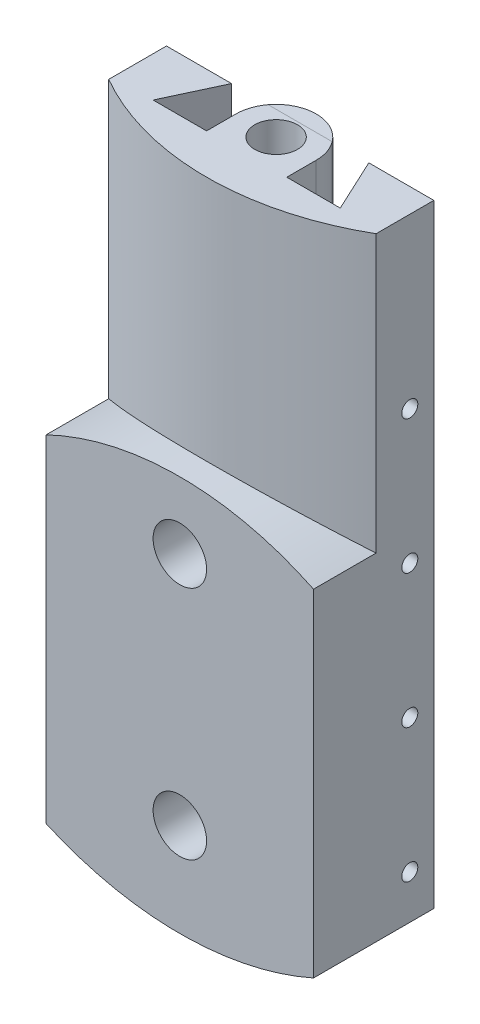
ISO-10303-21;
HEADER;
FILE_DESCRIPTION(('STEP AP214'),'2;1');
FILE_NAME('part.step','',(''),(''),'','','');
FILE_SCHEMA(('AUTOMOTIVE_DESIGN { 1 0 10303 214 1 1 1 1 }'));
ENDSEC;
DATA;
#1=APPLICATION_CONTEXT('core data for automotive mechanical design processes');
#2=APPLICATION_PROTOCOL_DEFINITION('international standard','automotive_design',2000,#1);
#3=PRODUCT_CONTEXT('',#1,'mechanical');
#4=PRODUCT('Part','Part','',(#3));
#5=PRODUCT_RELATED_PRODUCT_CATEGORY('part','',(#4));
#6=PRODUCT_DEFINITION_FORMATION('','',#4);
#7=PRODUCT_DEFINITION_CONTEXT('part definition',#1,'design');
#8=PRODUCT_DEFINITION('design','',#6,#7);
#9=PRODUCT_DEFINITION_SHAPE('','',#8);
#10=(LENGTH_UNIT() NAMED_UNIT(*) SI_UNIT(.MILLI.,.METRE.));
#11=(NAMED_UNIT(*) PLANE_ANGLE_UNIT() SI_UNIT($,.RADIAN.));
#12=(NAMED_UNIT(*) SI_UNIT($,.STERADIAN.) SOLID_ANGLE_UNIT());
#13=UNCERTAINTY_MEASURE_WITH_UNIT(LENGTH_MEASURE(1.E-05),#10,'distance_accuracy_value','');
#14=(GEOMETRIC_REPRESENTATION_CONTEXT(3) GLOBAL_UNCERTAINTY_ASSIGNED_CONTEXT((#13)) GLOBAL_UNIT_ASSIGNED_CONTEXT((#10,
#11,#12)) REPRESENTATION_CONTEXT('',''));
#15=CARTESIAN_POINT('',(0.,0.,0.));
#16=DIRECTION('',(0.,0.,1.));
#17=DIRECTION('',(1.,0.,0.));
#18=AXIS2_PLACEMENT_3D('',#15,#16,#17);
#19=CARTESIAN_POINT('',(0.,94.9999999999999,9.));
#20=DIRECTION('',(0.,1.,0.));
#21=DIRECTION('',(-1.,0.,0.));
#22=AXIS2_PLACEMENT_3D('',#19,#20,#21);
#23=CYLINDRICAL_SURFACE('',#22,15.);
#24=CARTESIAN_POINT('',(0.,120.,9.));
#25=DIRECTION('',(0.,1.,0.));
#26=DIRECTION('',(-1.,0.,0.));
#27=AXIS2_PLACEMENT_3D('',#24,#25,#26);
#28=CIRCLE('',#27,15.);
#29=CARTESIAN_POINT('',(11.9998799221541,120.,-0.000160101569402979));
#30=VERTEX_POINT('',#29);
#31=CARTESIAN_POINT('',(-11.9998799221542,120.,-0.000160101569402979));
#32=VERTEX_POINT('',#31);
#33=EDGE_CURVE('E72',#30,#32,#28,.T.);
#34=ORIENTED_EDGE('',*,*,#33,.F.);
#35=DIRECTION('',(0.,1.,0.));
#36=VECTOR('',#35,1.);
#37=CARTESIAN_POINT('',(11.9998799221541,94.9999999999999,-0.000160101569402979));
#38=LINE('',#37,#36);
#39=CARTESIAN_POINT('',(11.9998799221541,94.9999999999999,-0.000160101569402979));
#40=VERTEX_POINT('',#39);
#41=EDGE_CURVE('E12',#40,#30,#38,.T.);
#42=ORIENTED_EDGE('',*,*,#41,.F.);
#43=CARTESIAN_POINT('',(0.,94.9999999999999,9.));
#44=DIRECTION('',(0.,1.,0.));
#45=DIRECTION('',(-1.,0.,0.));
#46=AXIS2_PLACEMENT_3D('',#43,#44,#45);
#47=CIRCLE('',#46,15.);
#48=CARTESIAN_POINT('',(-11.9998799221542,94.9999999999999,-0.000160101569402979));
#49=VERTEX_POINT('',#48);
#50=EDGE_CURVE('E76',#40,#49,#47,.T.);
#51=ORIENTED_EDGE('',*,*,#50,.T.);
#52=DIRECTION('',(0.,1.,0.));
#53=VECTOR('',#52,1.);
#54=CARTESIAN_POINT('',(-11.9998799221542,94.9999999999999,-0.000160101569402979));
#55=LINE('',#54,#53);
#56=EDGE_CURVE('E46',#49,#32,#55,.T.);
#57=ORIENTED_EDGE('',*,*,#56,.T.);
#58=EDGE_LOOP('',(#34,#42,#51,#57));
#59=FACE_BOUND('',#58,.T.);
#60=ADVANCED_FACE('F43',(#59),#23,.T.);
#61=CARTESIAN_POINT('',(-11.9998799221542,94.9999999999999,-0.000160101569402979));
#62=DIRECTION('',(0.,0.,1.));
#63=DIRECTION('',(1.,0.,0.));
#64=AXIS2_PLACEMENT_3D('',#61,#62,#63);
#65=PLANE('',#64);
#66=DIRECTION('',(1.,0.,0.));
#67=VECTOR('',#66,1.);
#68=CARTESIAN_POINT('',(-11.9998799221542,120.,-0.000160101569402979));
#69=LINE('',#68,#67);
#70=EDGE_CURVE('E69',#32,#30,#69,.T.);
#71=ORIENTED_EDGE('',*,*,#70,.F.);
#72=ORIENTED_EDGE('',*,*,#56,.F.);
#73=DIRECTION('',(1.,0.,0.));
#74=VECTOR('',#73,1.);
#75=CARTESIAN_POINT('',(-11.9998799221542,94.9999999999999,-0.000160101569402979));
#76=LINE('',#75,#74);
#77=EDGE_CURVE('E71',#49,#40,#76,.T.);
#78=ORIENTED_EDGE('',*,*,#77,.T.);
#79=ORIENTED_EDGE('',*,*,#41,.T.);
#80=EDGE_LOOP('',(#71,#72,#78,#79));
#81=FACE_BOUND('',#80,.T.);
#82=ADVANCED_FACE('F67',(#81),#65,.T.);
#83=CARTESIAN_POINT('',(0.,94.9999999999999,9.));
#84=DIRECTION('',(0.,1.,0.));
#85=DIRECTION('',(-1.,0.,0.));
#86=AXIS2_PLACEMENT_3D('',#83,#84,#85);
#87=PLANE('',#86);
#88=ORIENTED_EDGE('',*,*,#50,.F.);
#89=ORIENTED_EDGE('',*,*,#77,.F.);
#90=EDGE_LOOP('',(#88,#89));
#91=FACE_BOUND('',#90,.T.);
#92=ADVANCED_FACE('F81',(#91),#87,.F.);
#93=CARTESIAN_POINT('',(0.,120.,9.));
#94=DIRECTION('',(0.,1.,0.));
#95=DIRECTION('',(-1.,0.,0.));
#96=AXIS2_PLACEMENT_3D('',#93,#94,#95);
#97=PLANE('',#96);
#98=ORIENTED_EDGE('',*,*,#33,.T.);
#99=ORIENTED_EDGE('',*,*,#70,.T.);
#100=EDGE_LOOP('',(#98,#99));
#101=FACE_BOUND('',#100,.T.);
#102=ADVANCED_FACE('F75',(#101),#97,.T.);
#103=CLOSED_SHELL('',(#60,#82,#92,#102));
#104=MANIFOLD_SOLID_BREP('B2',#103);
#105=CARTESIAN_POINT('',(50.,120.,45.));
#106=DIRECTION('',(0.,-1.,0.));
#107=DIRECTION('',(1.,0.,0.));
#108=AXIS2_PLACEMENT_3D('',#105,#106,#107);
#109=PLANE('',#108);
#110=CARTESIAN_POINT('',(0.,120.,9.));
#111=DIRECTION('',(0.,1.,0.));
#112=DIRECTION('',(-1.,0.,0.));
#113=AXIS2_PLACEMENT_3D('',#110,#111,#112);
#114=CIRCLE('',#113,8.);
#115=CARTESIAN_POINT('',(-8.00000000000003,120.,9.));
#116=VERTEX_POINT('',#115);
#117=EDGE_CURVE('E285',#116,#116,#114,.T.);
#118=ORIENTED_EDGE('',*,*,#117,.F.);
#119=EDGE_LOOP('',(#118));
#120=FACE_BOUND('',#119,.T.);
#121=CARTESIAN_POINT('',(0.,120.,9.));
#122=DIRECTION('',(0.,1.,0.));
#123=DIRECTION('',(-1.,0.,0.));
#124=AXIS2_PLACEMENT_3D('',#121,#122,#123);
#125=CIRCLE('',#124,15.);
#126=CARTESIAN_POINT('',(15.,120.,9.));
#127=VERTEX_POINT('',#126);
#128=CARTESIAN_POINT('',(12.,120.,0.));
#129=VERTEX_POINT('',#128);
#130=EDGE_CURVE('E329',#127,#129,#125,.T.);
#131=ORIENTED_EDGE('',*,*,#130,.T.);
#132=DIRECTION('',(-1.,0.,0.));
#133=VECTOR('',#132,1.);
#134=CARTESIAN_POINT('',(50.,120.,0.));
#135=LINE('',#134,#133);
#136=CARTESIAN_POINT('',(-12.,120.,0.));
#137=VERTEX_POINT('',#136);
#138=EDGE_CURVE('E278',#129,#137,#135,.T.);
#139=ORIENTED_EDGE('',*,*,#138,.T.);
#140=CARTESIAN_POINT('',(0.,120.,9.));
#141=DIRECTION('',(0.,1.,0.));
#142=DIRECTION('',(-1.,0.,0.));
#143=AXIS2_PLACEMENT_3D('',#140,#141,#142);
#144=CIRCLE('',#143,15.);
#145=CARTESIAN_POINT('',(-15.,120.,9.));
#146=VERTEX_POINT('',#145);
#147=EDGE_CURVE('E343',#137,#146,#144,.T.);
#148=ORIENTED_EDGE('',*,*,#147,.T.);
#149=DIRECTION('',(0.,0.,1.));
#150=VECTOR('',#149,1.);
#151=CARTESIAN_POINT('',(-15.,120.,0.));
#152=LINE('',#151,#150);
#153=CARTESIAN_POINT('',(-15.,120.,20.));
#154=VERTEX_POINT('',#153);
#155=EDGE_CURVE('E360',#146,#154,#152,.T.);
#156=ORIENTED_EDGE('',*,*,#155,.T.);
#157=DIRECTION('',(-1.,0.,0.));
#158=VECTOR('',#157,1.);
#159=CARTESIAN_POINT('',(0.,120.,20.));
#160=LINE('',#159,#158);
#161=CARTESIAN_POINT('',(-35.,120.,20.));
#162=VERTEX_POINT('',#161);
#163=EDGE_CURVE('E357',#154,#162,#160,.T.);
#164=ORIENTED_EDGE('',*,*,#163,.T.);
#165=DIRECTION('',(0.422618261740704,0.,-0.906307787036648));
#166=VECTOR('',#165,1.);
#167=CARTESIAN_POINT('',(-21.0883387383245,120.,-9.83365385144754));
#168=LINE('',#167,#166);
#169=CARTESIAN_POINT('',(-25.6738468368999,120.,0.));
#170=VERTEX_POINT('',#169);
#171=EDGE_CURVE('E354',#162,#170,#168,.T.);
#172=ORIENTED_EDGE('',*,*,#171,.T.);
#173=CARTESIAN_POINT('',(-50.,120.,0.));
#174=VERTEX_POINT('',#173);
#175=EDGE_CURVE('E276',#170,#174,#135,.T.);
#176=ORIENTED_EDGE('',*,*,#175,.T.);
#177=DIRECTION('',(0.,0.,-1.));
#178=VECTOR('',#177,1.);
#179=CARTESIAN_POINT('',(-50.,120.,45.));
#180=LINE('',#179,#178);
#181=CARTESIAN_POINT('',(-50.,120.,21.6025403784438));
#182=VERTEX_POINT('',#181);
#183=EDGE_CURVE('E261',#182,#174,#180,.T.);
#184=ORIENTED_EDGE('',*,*,#183,.F.);
#185=CARTESIAN_POINT('',(2.23432383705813E-13,120.,-65.));
#186=DIRECTION('',(0.,-1.,0.));
#187=DIRECTION('',(1.,0.,0.));
#188=AXIS2_PLACEMENT_3D('',#185,#186,#187);
#189=CIRCLE('',#188,100.);
#190=CARTESIAN_POINT('',(50.,120.,21.602540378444));
#191=VERTEX_POINT('',#190);
#192=EDGE_CURVE('E366',#191,#182,#189,.T.);
#193=ORIENTED_EDGE('',*,*,#192,.F.);
#194=DIRECTION('',(0.,0.,-1.));
#195=VECTOR('',#194,1.);
#196=CARTESIAN_POINT('',(50.,120.,45.));
#197=LINE('',#196,#195);
#198=CARTESIAN_POINT('',(50.,120.,0.));
#199=VERTEX_POINT('',#198);
#200=EDGE_CURVE('E127',#191,#199,#197,.T.);
#201=ORIENTED_EDGE('',*,*,#200,.T.);
#202=CARTESIAN_POINT('',(25.6738468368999,120.,0.));
#203=VERTEX_POINT('',#202);
#204=EDGE_CURVE('E266',#199,#203,#135,.T.);
#205=ORIENTED_EDGE('',*,*,#204,.T.);
#206=DIRECTION('',(-0.422618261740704,0.,-0.906307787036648));
#207=VECTOR('',#206,1.);
#208=CARTESIAN_POINT('',(21.0883387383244,120.,-9.83365385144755));
#209=LINE('',#208,#207);
#210=CARTESIAN_POINT('',(35.,120.,20.));
#211=VERTEX_POINT('',#210);
#212=EDGE_CURVE('E338',#211,#203,#209,.T.);
#213=ORIENTED_EDGE('',*,*,#212,.F.);
#214=DIRECTION('',(1.,0.,0.));
#215=VECTOR('',#214,1.);
#216=CARTESIAN_POINT('',(0.,120.,20.));
#217=LINE('',#216,#215);
#218=CARTESIAN_POINT('',(15.,120.,20.));
#219=VERTEX_POINT('',#218);
#220=EDGE_CURVE('E335',#219,#211,#217,.T.);
#221=ORIENTED_EDGE('',*,*,#220,.F.);
#222=DIRECTION('',(0.,0.,1.));
#223=VECTOR('',#222,1.);
#224=CARTESIAN_POINT('',(15.,120.,0.));
#225=LINE('',#224,#223);
#226=EDGE_CURVE('E332',#127,#219,#225,.T.);
#227=ORIENTED_EDGE('',*,*,#226,.F.);
#228=EDGE_LOOP('',(#131,#139,#148,#156,#164,#172,#176,#184,#193,#201,#205,#213,#221,#227));
#229=FACE_BOUND('',#228,.T.);
#230=ADVANCED_FACE('F115',(#120,#229),#109,.F.);
#231=CARTESIAN_POINT('',(0.,0.,0.));
#232=DIRECTION('',(0.,0.,1.));
#233=DIRECTION('',(1.,0.,0.));
#234=AXIS2_PLACEMENT_3D('',#231,#232,#233);
#235=PLANE('',#234);
#236=DIRECTION('',(0.,1.,0.));
#237=VECTOR('',#236,1.);
#238=CARTESIAN_POINT('',(12.,-120.,0.));
#239=LINE('',#238,#237);
#240=CARTESIAN_POINT('',(12.,-119.413234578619,0.));
#241=VERTEX_POINT('',#240);
#242=EDGE_CURVE('E341',#241,#129,#239,.T.);
#243=ORIENTED_EDGE('',*,*,#242,.F.);
#244=CARTESIAN_POINT('',(0.,3.,0.));
#245=DIRECTION('',(0.,0.,1.));
#246=DIRECTION('',(1.,0.,0.));
#247=AXIS2_PLACEMENT_3D('',#244,#245,#246);
#248=CIRCLE('',#247,123.);
#249=CARTESIAN_POINT('',(-12.,-119.413234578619,0.));
#250=VERTEX_POINT('',#249);
#251=EDGE_CURVE('E407',#241,#250,#248,.F.);
#252=ORIENTED_EDGE('',*,*,#251,.T.);
#253=DIRECTION('',(0.,1.,0.));
#254=VECTOR('',#253,1.);
#255=CARTESIAN_POINT('',(-12.,-120.,0.));
#256=LINE('',#255,#254);
#257=EDGE_CURVE('E363',#250,#137,#256,.T.);
#258=ORIENTED_EDGE('',*,*,#257,.T.);
#259=ORIENTED_EDGE('',*,*,#138,.F.);
#260=EDGE_LOOP('',(#243,#252,#258,#259));
#261=FACE_BOUND('',#260,.T.);
#262=ADVANCED_FACE('F471',(#261),#235,.F.);
#263=DIRECTION('',(0.,1.,0.));
#264=VECTOR('',#263,1.);
#265=CARTESIAN_POINT('',(50.,-120.,0.));
#266=LINE('',#265,#264);
#267=CARTESIAN_POINT('',(49.9999999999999,-109.378823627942,1.11022302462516E-13));
#268=VERTEX_POINT('',#267);
#269=EDGE_CURVE('E273',#268,#199,#266,.T.);
#270=ORIENTED_EDGE('',*,*,#269,.F.);
#271=CARTESIAN_POINT('',(0.,3.,0.));
#272=DIRECTION('',(0.,0.,1.));
#273=DIRECTION('',(1.,0.,0.));
#274=AXIS2_PLACEMENT_3D('',#271,#272,#273);
#275=CIRCLE('',#274,123.);
#276=CARTESIAN_POINT('',(25.6738468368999,-117.290704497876,0.));
#277=VERTEX_POINT('',#276);
#278=EDGE_CURVE('E409',#268,#277,#275,.F.);
#279=ORIENTED_EDGE('',*,*,#278,.T.);
#280=DIRECTION('',(0.,1.,0.));
#281=VECTOR('',#280,1.);
#282=CARTESIAN_POINT('',(25.6738468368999,-120.,0.));
#283=LINE('',#282,#281);
#284=EDGE_CURVE('E142',#277,#203,#283,.T.);
#285=ORIENTED_EDGE('',*,*,#284,.T.);
#286=ORIENTED_EDGE('',*,*,#204,.F.);
#287=EDGE_LOOP('',(#270,#279,#285,#286));
#288=FACE_BOUND('',#287,.T.);
#289=ADVANCED_FACE('F477',(#288),#235,.F.);
#290=DIRECTION('',(0.,1.,0.));
#291=VECTOR('',#290,1.);
#292=CARTESIAN_POINT('',(-25.6738468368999,-120.,0.));
#293=LINE('',#292,#291);
#294=CARTESIAN_POINT('',(-25.6738468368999,-117.290704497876,0.));
#295=VERTEX_POINT('',#294);
#296=EDGE_CURVE('E371',#295,#170,#293,.T.);
#297=ORIENTED_EDGE('',*,*,#296,.F.);
#298=CARTESIAN_POINT('',(0.,3.,0.));
#299=DIRECTION('',(0.,0.,1.));
#300=DIRECTION('',(1.,0.,0.));
#301=AXIS2_PLACEMENT_3D('',#298,#299,#300);
#302=CIRCLE('',#301,123.);
#303=CARTESIAN_POINT('',(-50.,-109.378823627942,1.11022302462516E-13));
#304=VERTEX_POINT('',#303);
#305=EDGE_CURVE('E520',#295,#304,#302,.F.);
#306=ORIENTED_EDGE('',*,*,#305,.T.);
#307=DIRECTION('',(0.,-1.,0.));
#308=VECTOR('',#307,1.);
#309=CARTESIAN_POINT('',(-50.,-120.,0.));
#310=LINE('',#309,#308);
#311=EDGE_CURVE('E270',#174,#304,#310,.T.);
#312=ORIENTED_EDGE('',*,*,#311,.F.);
#313=ORIENTED_EDGE('',*,*,#175,.F.);
#314=EDGE_LOOP('',(#297,#306,#312,#313));
#315=FACE_BOUND('',#314,.T.);
#316=ADVANCED_FACE('F480',(#315),#235,.F.);
#317=CARTESIAN_POINT('',(-50.,-120.,45.));
#318=DIRECTION('',(1.,0.,0.));
#319=DIRECTION('',(0.,0.,-1.));
#320=AXIS2_PLACEMENT_3D('',#317,#318,#319);
#321=PLANE('',#320);
#322=CARTESIAN_POINT('',(-50.,7.00000000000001,8.99999999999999));
#323=DIRECTION('',(1.,0.,0.));
#324=DIRECTION('',(0.,0.,-1.));
#325=AXIS2_PLACEMENT_3D('',#322,#323,#324);
#326=CIRCLE('',#325,3.);
#327=CARTESIAN_POINT('',(-50.,7.00000000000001,5.99999999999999));
#328=VERTEX_POINT('',#327);
#329=EDGE_CURVE('E306',#328,#328,#326,.T.);
#330=ORIENTED_EDGE('',*,*,#329,.T.);
#331=EDGE_LOOP('',(#330));
#332=FACE_BOUND('',#331,.T.);
#333=CARTESIAN_POINT('',(-50.,-43.,8.99999999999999));
#334=DIRECTION('',(1.,0.,0.));
#335=DIRECTION('',(0.,0.,-1.));
#336=AXIS2_PLACEMENT_3D('',#333,#334,#335);
#337=CIRCLE('',#336,3.);
#338=CARTESIAN_POINT('',(-50.,-43.,5.99999999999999));
#339=VERTEX_POINT('',#338);
#340=EDGE_CURVE('E805',#339,#339,#337,.T.);
#341=ORIENTED_EDGE('',*,*,#340,.T.);
#342=EDGE_LOOP('',(#341));
#343=FACE_BOUND('',#342,.T.);
#344=CARTESIAN_POINT('',(-50.,-93.,8.99999999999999));
#345=DIRECTION('',(1.,0.,0.));
#346=DIRECTION('',(0.,0.,-1.));
#347=AXIS2_PLACEMENT_3D('',#344,#345,#346);
#348=CIRCLE('',#347,3.);
#349=CARTESIAN_POINT('',(-50.,-93.,5.99999999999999));
#350=VERTEX_POINT('',#349);
#351=EDGE_CURVE('E318',#350,#350,#348,.T.);
#352=ORIENTED_EDGE('',*,*,#351,.T.);
#353=EDGE_LOOP('',(#352));
#354=FACE_BOUND('',#353,.T.);
#355=CARTESIAN_POINT('',(-50.,57.,8.99999999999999));
#356=DIRECTION('',(1.,0.,0.));
#357=DIRECTION('',(0.,0.,-1.));
#358=AXIS2_PLACEMENT_3D('',#355,#356,#357);
#359=CIRCLE('',#358,3.);
#360=CARTESIAN_POINT('',(-50.,57.,5.99999999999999));
#361=VERTEX_POINT('',#360);
#362=EDGE_CURVE('E301',#361,#361,#359,.T.);
#363=ORIENTED_EDGE('',*,*,#362,.T.);
#364=EDGE_LOOP('',(#363));
#365=FACE_BOUND('',#364,.T.);
#366=DIRECTION('',(0.,0.,1.));
#367=VECTOR('',#366,1.);
#368=CARTESIAN_POINT('',(-50.,16.5615758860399,-6.00100000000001));
#369=LINE('',#368,#367);
#370=CARTESIAN_POINT('',(-50.,16.5615758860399,21.6025403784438));
#371=VERTEX_POINT('',#370);
#372=CARTESIAN_POINT('',(-50.,16.5615758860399,45.));
#373=VERTEX_POINT('',#372);
#374=EDGE_CURVE('E240',#371,#373,#369,.T.);
#375=ORIENTED_EDGE('',*,*,#374,.F.);
#376=DIRECTION('',(0.,-1.,0.));
#377=VECTOR('',#376,1.);
#378=CARTESIAN_POINT('',(-50.0000000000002,749.831870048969,21.6025403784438));
#379=LINE('',#378,#377);
#380=EDGE_CURVE('E274',#182,#371,#379,.T.);
#381=ORIENTED_EDGE('',*,*,#380,.F.);
#382=ORIENTED_EDGE('',*,*,#183,.T.);
#383=ORIENTED_EDGE('',*,*,#311,.T.);
#384=DIRECTION('',(0.,0.,-1.));
#385=VECTOR('',#384,1.);
#386=CARTESIAN_POINT('',(-50.,-109.378823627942,432.443591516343));
#387=LINE('',#386,#385);
#388=CARTESIAN_POINT('',(-50.,-109.378823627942,45.0000000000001));
#389=VERTEX_POINT('',#388);
#390=EDGE_CURVE('E399',#389,#304,#387,.T.);
#391=ORIENTED_EDGE('',*,*,#390,.F.);
#392=DIRECTION('',(0.,-1.,0.));
#393=VECTOR('',#392,1.);
#394=CARTESIAN_POINT('',(-50.,-120.,45.));
#395=LINE('',#394,#393);
#396=EDGE_CURVE('E262',#373,#389,#395,.T.);
#397=ORIENTED_EDGE('',*,*,#396,.F.);
#398=EDGE_LOOP('',(#375,#381,#382,#383,#391,#397));
#399=FACE_BOUND('',#398,.T.);
#400=ADVANCED_FACE('F117',(#332,#343,#354,#365,#399),#321,.F.);
#401=CARTESIAN_POINT('',(50.,-120.,45.));
#402=DIRECTION('',(-1.,0.,0.));
#403=DIRECTION('',(0.,0.,1.));
#404=AXIS2_PLACEMENT_3D('',#401,#402,#403);
#405=PLANE('',#404);
#406=CARTESIAN_POINT('',(50.,7.00000000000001,8.99999999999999));
#407=DIRECTION('',(1.,0.,0.));
#408=DIRECTION('',(0.,0.,-1.));
#409=AXIS2_PLACEMENT_3D('',#406,#407,#408);
#410=CIRCLE('',#409,3.);
#411=CARTESIAN_POINT('',(50.,7.00000000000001,5.99999999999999));
#412=VERTEX_POINT('',#411);
#413=EDGE_CURVE('E291',#412,#412,#410,.T.);
#414=ORIENTED_EDGE('',*,*,#413,.F.);
#415=EDGE_LOOP('',(#414));
#416=FACE_BOUND('',#415,.T.);
#417=CARTESIAN_POINT('',(50.,-43.,8.99999999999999));
#418=DIRECTION('',(1.,0.,0.));
#419=DIRECTION('',(0.,0.,-1.));
#420=AXIS2_PLACEMENT_3D('',#417,#418,#419);
#421=CIRCLE('',#420,3.);
#422=CARTESIAN_POINT('',(50.,-43.,5.99999999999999));
#423=VERTEX_POINT('',#422);
#424=EDGE_CURVE('E322',#423,#423,#421,.T.);
#425=ORIENTED_EDGE('',*,*,#424,.F.);
#426=EDGE_LOOP('',(#425));
#427=FACE_BOUND('',#426,.T.);
#428=CARTESIAN_POINT('',(50.,-93.,8.99999999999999));
#429=DIRECTION('',(1.,0.,0.));
#430=DIRECTION('',(0.,0.,-1.));
#431=AXIS2_PLACEMENT_3D('',#428,#429,#430);
#432=CIRCLE('',#431,3.);
#433=CARTESIAN_POINT('',(50.,-93.,5.99999999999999));
#434=VERTEX_POINT('',#433);
#435=EDGE_CURVE('E300',#434,#434,#432,.T.);
#436=ORIENTED_EDGE('',*,*,#435,.F.);
#437=EDGE_LOOP('',(#436));
#438=FACE_BOUND('',#437,.T.);
#439=CARTESIAN_POINT('',(50.,57.,8.99999999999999));
#440=DIRECTION('',(1.,0.,0.));
#441=DIRECTION('',(0.,0.,-1.));
#442=AXIS2_PLACEMENT_3D('',#439,#440,#441);
#443=CIRCLE('',#442,3.);
#444=CARTESIAN_POINT('',(50.,57.,5.99999999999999));
#445=VERTEX_POINT('',#444);
#446=EDGE_CURVE('E286',#445,#445,#443,.T.);
#447=ORIENTED_EDGE('',*,*,#446,.F.);
#448=EDGE_LOOP('',(#447));
#449=FACE_BOUND('',#448,.T.);
#450=DIRECTION('',(0.,-1.,0.));
#451=VECTOR('',#450,1.);
#452=CARTESIAN_POINT('',(49.9999999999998,749.831870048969,21.602540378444));
#453=LINE('',#452,#451);
#454=CARTESIAN_POINT('',(50.,16.5615758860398,21.602540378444));
#455=VERTEX_POINT('',#454);
#456=EDGE_CURVE('E253',#191,#455,#453,.T.);
#457=ORIENTED_EDGE('',*,*,#456,.T.);
#458=DIRECTION('',(0.,0.,1.));
#459=VECTOR('',#458,1.);
#460=CARTESIAN_POINT('',(50.,16.5615758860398,-6.00100000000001));
#461=LINE('',#460,#459);
#462=CARTESIAN_POINT('',(50.,16.5615758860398,45.));
#463=VERTEX_POINT('',#462);
#464=EDGE_CURVE('E238',#455,#463,#461,.T.);
#465=ORIENTED_EDGE('',*,*,#464,.T.);
#466=DIRECTION('',(0.,1.,0.));
#467=VECTOR('',#466,1.);
#468=CARTESIAN_POINT('',(50.,-120.,45.));
#469=LINE('',#468,#467);
#470=CARTESIAN_POINT('',(49.9999999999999,-109.378823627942,45.0000000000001));
#471=VERTEX_POINT('',#470);
#472=EDGE_CURVE('E250',#471,#463,#469,.T.);
#473=ORIENTED_EDGE('',*,*,#472,.F.);
#474=DIRECTION('',(0.,0.,-1.));
#475=VECTOR('',#474,1.);
#476=CARTESIAN_POINT('',(49.9999999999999,-109.378823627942,432.443591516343));
#477=LINE('',#476,#475);
#478=EDGE_CURVE('E402',#471,#268,#477,.T.);
#479=ORIENTED_EDGE('',*,*,#478,.T.);
#480=ORIENTED_EDGE('',*,*,#269,.T.);
#481=ORIENTED_EDGE('',*,*,#200,.F.);
#482=EDGE_LOOP('',(#457,#465,#473,#479,#480,#481));
#483=FACE_BOUND('',#482,.T.);
#484=ADVANCED_FACE('F248',(#416,#427,#438,#449,#483),#405,.F.);
#485=CARTESIAN_POINT('',(0.,0.,45.));
#486=DIRECTION('',(0.,0.,1.));
#487=DIRECTION('',(1.,0.,0.));
#488=AXIS2_PLACEMENT_3D('',#485,#486,#487);
#489=PLANE('',#488);
#490=ORIENTED_EDGE('',*,*,#472,.T.);
#491=CARTESIAN_POINT('',(-1.17266383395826E-13,-87.0000000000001,45.));
#492=DIRECTION('',(0.,0.,1.));
#493=DIRECTION('',(1.,0.,0.));
#494=AXIS2_PLACEMENT_3D('',#491,#492,#493);
#495=CIRCLE('',#494,115.);
#496=EDGE_CURVE('E234',#373,#463,#495,.F.);
#497=ORIENTED_EDGE('',*,*,#496,.F.);
#498=ORIENTED_EDGE('',*,*,#396,.T.);
#499=CARTESIAN_POINT('',(0.,3.,45.));
#500=DIRECTION('',(0.,0.,1.));
#501=DIRECTION('',(1.,0.,0.));
#502=AXIS2_PLACEMENT_3D('',#499,#500,#501);
#503=CIRCLE('',#502,123.);
#504=EDGE_CURVE('E260',#471,#389,#503,.F.);
#505=ORIENTED_EDGE('',*,*,#504,.F.);
#506=EDGE_LOOP('',(#490,#497,#498,#505));
#507=FACE_BOUND('',#506,.T.);
#508=CARTESIAN_POINT('',(0.,3.,45.));
#509=DIRECTION('',(0.,0.,1.));
#510=DIRECTION('',(1.,0.,0.));
#511=AXIS2_PLACEMENT_3D('',#508,#509,#510);
#512=CIRCLE('',#511,10.);
#513=CARTESIAN_POINT('',(10.,3.,45.));
#514=VERTEX_POINT('',#513);
#515=EDGE_CURVE('E382',#514,#514,#512,.T.);
#516=ORIENTED_EDGE('',*,*,#515,.F.);
#517=EDGE_LOOP('',(#516));
#518=FACE_BOUND('',#517,.T.);
#519=CARTESIAN_POINT('',(0.,-85.,45.));
#520=DIRECTION('',(0.,0.,1.));
#521=DIRECTION('',(1.,0.,0.));
#522=AXIS2_PLACEMENT_3D('',#519,#520,#521);
#523=CIRCLE('',#522,10.);
#524=CARTESIAN_POINT('',(10.,-85.,45.));
#525=VERTEX_POINT('',#524);
#526=EDGE_CURVE('E394',#525,#525,#523,.T.);
#527=ORIENTED_EDGE('',*,*,#526,.F.);
#528=EDGE_LOOP('',(#527));
#529=FACE_BOUND('',#528,.T.);
#530=ADVANCED_FACE('F257',(#507,#518,#529),#489,.T.);
#531=CARTESIAN_POINT('',(0.,749.831870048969,-65.));
#532=DIRECTION('',(0.,-1.,0.));
#533=DIRECTION('',(1.,0.,0.));
#534=AXIS2_PLACEMENT_3D('',#531,#532,#533);
#535=CYLINDRICAL_SURFACE('',#534,100.);
#536=ORIENTED_EDGE('',*,*,#192,.T.);
#537=ORIENTED_EDGE('',*,*,#380,.T.);
#538=CARTESIAN_POINT('',(-50.,16.5615758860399,21.6025403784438));
#539=CARTESIAN_POINT('',(-49.0621204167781,17.0143971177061,22.144029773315));
#540=CARTESIAN_POINT('',(-48.1118651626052,17.4574656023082,22.6723413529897));
#541=CARTESIAN_POINT('',(-46.1870854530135,18.3226762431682,23.7014319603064));
#542=CARTESIAN_POINT('',(-45.2125584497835,18.7448161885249,24.2022080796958));
#543=CARTESIAN_POINT('',(-43.2389903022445,19.5670382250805,25.1753923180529));
#544=CARTESIAN_POINT('',(-42.239927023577,19.967099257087,25.6477733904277));
#545=CARTESIAN_POINT('',(-40.2189600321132,20.7432450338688,26.5623579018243));
#546=CARTESIAN_POINT('',(-39.1970569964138,21.1193304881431,27.0045622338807));
#547=CARTESIAN_POINT('',(-37.1265064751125,21.8477492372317,27.8594788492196));
#548=CARTESIAN_POINT('',(-36.0777570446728,22.1999644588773,28.2720450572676));
#549=CARTESIAN_POINT('',(-33.9592042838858,22.8772457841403,29.0640807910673));
#550=CARTESIAN_POINT('',(-32.8894012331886,23.2023122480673,29.4435507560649));
#551=CARTESIAN_POINT('',(-30.7303555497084,23.8237643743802,30.1679640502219));
#552=CARTESIAN_POINT('',(-29.6411192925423,24.1201592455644,30.5129184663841));
#553=CARTESIAN_POINT('',(-27.4443514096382,24.6830028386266,31.1671510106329));
#554=CARTESIAN_POINT('',(-26.3368201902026,24.9494522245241,31.476429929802));
#555=CARTESIAN_POINT('',(-24.2070568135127,25.4281923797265,32.0315223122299));
#556=CARTESIAN_POINT('',(-23.1862739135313,25.6432070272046,32.280552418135));
#557=CARTESIAN_POINT('',(-21.132267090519,26.046551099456,32.7473094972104));
#558=CARTESIAN_POINT('',(-20.0990423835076,26.2348788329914,32.965034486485));
#559=CARTESIAN_POINT('',(-18.0217410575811,26.5840045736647,33.3683703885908));
#560=CARTESIAN_POINT('',(-16.9776646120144,26.7448030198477,33.5539818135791));
#561=CARTESIAN_POINT('',(-14.8802685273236,27.0381465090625,33.8923959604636));
#562=CARTESIAN_POINT('',(-13.8269489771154,27.1706918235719,34.0451989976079));
#563=CARTESIAN_POINT('',(-11.715792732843,27.4065781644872,34.3170160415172));
#564=CARTESIAN_POINT('',(-10.6579774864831,27.5100013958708,34.4361251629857));
#565=CARTESIAN_POINT('',(-8.53674559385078,27.6876482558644,34.6406504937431));
#566=CARTESIAN_POINT('',(-7.4733294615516,27.7618745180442,34.726069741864));
#567=CARTESIAN_POINT('',(-5.34251281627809,27.8807917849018,34.8628933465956));
#568=CARTESIAN_POINT('',(-4.27511177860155,27.9254787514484,34.9142930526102));
#569=CARTESIAN_POINT('',(-2.13847811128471,27.9850818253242,34.9828451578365));
#570=CARTESIAN_POINT('',(-1.06924564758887,28.0000005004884,35.0000005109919));
#571=CARTESIAN_POINT('',(1.17063692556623,27.9999994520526,34.9999994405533));
#572=CARTESIAN_POINT('',(2.34128965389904,27.9821161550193,34.9794351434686));
#573=CARTESIAN_POINT('',(4.68007626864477,27.9106858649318,34.8972779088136));
#574=CARTESIAN_POINT('',(5.84821010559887,27.8571381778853,34.8356841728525));
#575=CARTESIAN_POINT('',(8.17956366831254,27.7146840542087,34.6717632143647));
#576=CARTESIAN_POINT('',(9.34278290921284,27.6257742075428,34.5694320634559));
#577=CARTESIAN_POINT('',(11.6617616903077,27.4131070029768,34.3245324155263));
#578=CARTESIAN_POINT('',(12.817521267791,27.2893498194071,34.1819641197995));
#579=CARTESIAN_POINT('',(15.1231668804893,27.0072072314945,33.8567138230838));
#580=CARTESIAN_POINT('',(16.2730197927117,26.8487060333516,33.6738976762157));
#581=CARTESIAN_POINT('',(18.5606898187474,26.4981933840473,33.2692735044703));
#582=CARTESIAN_POINT('',(19.6985068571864,26.3061817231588,33.0474652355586));
#583=CARTESIAN_POINT('',(21.9599230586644,25.8896962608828,32.5658656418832));
#584=CARTESIAN_POINT('',(23.0835237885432,25.6652260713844,32.3060785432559));
#585=CARTESIAN_POINT('',(25.3147486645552,25.1849623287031,31.7496021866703));
#586=CARTESIAN_POINT('',(26.4223730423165,24.9291692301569,31.4529134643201));
#587=CARTESIAN_POINT('',(28.5303744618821,24.4095960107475,30.8494636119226));
#588=CARTESIAN_POINT('',(29.5321328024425,24.1481673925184,30.5454958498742));
#589=CARTESIAN_POINT('',(31.5196269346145,23.6009760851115,29.9083899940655));
#590=CARTESIAN_POINT('',(32.5053615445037,23.3152116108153,29.5752497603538));
#591=CARTESIAN_POINT('',(35.4369538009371,22.42300307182,28.5335364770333));
#592=CARTESIAN_POINT('',(37.3573995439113,21.7815943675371,27.7826134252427));
#593=CARTESIAN_POINT('',(41.1115493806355,20.4188315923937,26.1810356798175));
#594=CARTESIAN_POINT('',(42.9457055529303,19.6979813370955,25.3310077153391));
#595=CARTESIAN_POINT('',(45.6368179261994,18.5614938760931,23.9847555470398));
#596=CARTESIAN_POINT('',(46.5236553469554,18.173549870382,23.5242405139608));
#597=CARTESIAN_POINT('',(48.2770736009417,17.3803138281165,22.5803357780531));
#598=CARTESIAN_POINT('',(49.1436559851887,16.9750231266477,22.0969478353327));
#599=CARTESIAN_POINT('',(50.,16.5615758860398,21.602540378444));
#600=B_SPLINE_CURVE_WITH_KNOTS('',3,(#538,#539,#540,#541,#542,#543,#544,#545,#546,#547,#548,
#549,#550,#551,#552,#553,#554,#555,#556,#557,#558,#559,#560,#561,#562,#563,#564,#565,#566,#567,
#568,#569,#570,#571,#572,#573,#574,#575,#576,#577,#578,#579,#580,#581,#582,#583,#584,#585,#586,
#587,#588,#589,#590,#591,#592,#593,#594,#595,#596,#597,#598,#599),.UNSPECIFIED.,.F.,.F.,(4,2,2,
2,2,2,2,2,2,2,2,2,2,2,2,2,2,2,2,2,2,2,2,2,2,2,2,2,2,2,4),(0.,3.52137864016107,7.04312849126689,
10.5681813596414,14.0931298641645,17.6344038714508,21.1756308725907,24.7157166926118,
28.2557239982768,31.4723765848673,34.6892329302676,37.9060379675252,41.12281209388,
44.3304128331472,47.5377241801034,50.7454738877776,53.9529468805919,57.4645686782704,
60.976258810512,64.4882876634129,68.0002989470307,71.5241979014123,75.048118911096,
78.571648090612,82.0951261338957,85.3313330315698,88.567777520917,95.0400274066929,
101.473366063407,104.68868678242,107.903760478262),.UNSPECIFIED.);
#601=EDGE_CURVE('E244',#371,#455,#600,.T.);
#602=ORIENTED_EDGE('',*,*,#601,.T.);
#603=ORIENTED_EDGE('',*,*,#456,.F.);
#604=EDGE_LOOP('',(#536,#537,#602,#603));
#605=FACE_BOUND('',#604,.T.);
#606=ADVANCED_FACE('F377',(#605),#535,.T.);
#607=CARTESIAN_POINT('',(0.,-120.,9.));
#608=DIRECTION('',(0.,1.,0.));
#609=DIRECTION('',(-1.,0.,0.));
#610=AXIS2_PLACEMENT_3D('',#607,#608,#609);
#611=CYLINDRICAL_SURFACE('',#610,15.);
#612=CARTESIAN_POINT('',(-15.,-119.081939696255,9.));
#613=CARTESIAN_POINT('',(-14.9999997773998,-119.081938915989,8.78717375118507));
#614=CARTESIAN_POINT('',(-14.9954697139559,-119.082496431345,8.57437485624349));
#615=CARTESIAN_POINT('',(-14.9773622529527,-119.084719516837,8.14916759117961));
#616=CARTESIAN_POINT('',(-14.9637848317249,-119.086385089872,7.93675922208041));
#617=CARTESIAN_POINT('',(-14.909509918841,-119.093029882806,7.30074050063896));
#618=CARTESIAN_POINT('',(-14.8552697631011,-119.09965718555,6.87822054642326));
#619=CARTESIAN_POINT('',(-14.7130034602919,-119.116880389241,6.05055271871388));
#620=CARTESIAN_POINT('',(-14.6259073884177,-119.127366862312,5.64524074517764));
#621=CARTESIAN_POINT('',(-14.4185152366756,-119.152025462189,4.84333366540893));
#622=CARTESIAN_POINT('',(-14.2982224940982,-119.166197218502,4.44673768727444));
#623=CARTESIAN_POINT('',(-14.036515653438,-119.196530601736,3.69710865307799));
#624=CARTESIAN_POINT('',(-13.8976476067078,-119.212433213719,3.34317291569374));
#625=CARTESIAN_POINT('',(-13.5934990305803,-119.246636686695,2.64696211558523));
#626=CARTESIAN_POINT('',(-13.4282191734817,-119.264937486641,2.30468675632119));
#627=CARTESIAN_POINT('',(-13.0677720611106,-119.303994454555,1.62539729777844));
#628=CARTESIAN_POINT('',(-12.8719629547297,-119.324800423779,1.28872655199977));
#629=CARTESIAN_POINT('',(-12.4548180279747,-119.367974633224,0.631653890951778));
#630=CARTESIAN_POINT('',(-12.2334800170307,-119.390343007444,0.31125337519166));
#631=CARTESIAN_POINT('',(-12.,-119.413234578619,0.));
#632=B_SPLINE_CURVE_WITH_KNOTS('',3,(#612,#613,#614,#615,#616,#617,#618,#619,#620,#621,#622,
#623,#624,#625,#626,#627,#628,#629,#630,#631),.UNSPECIFIED.,.F.,.F.,(4,2,2,2,2,2,2,2,2,4),(0.,
0.638375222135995,1.2767521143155,2.55315908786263,3.79585770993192,5.03843144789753,
6.17895444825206,7.31944842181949,8.48834754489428,9.65734704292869),.UNSPECIFIED.);
#633=CARTESIAN_POINT('',(-15.,-119.081939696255,9.));
#634=VERTEX_POINT('',#633);
#635=EDGE_CURVE('E404',#634,#250,#632,.T.);
#636=ORIENTED_EDGE('',*,*,#635,.F.);
#637=DIRECTION('',(0.,1.,0.));
#638=VECTOR('',#637,1.);
#639=CARTESIAN_POINT('',(-15.,-120.,9.));
#640=LINE('',#639,#638);
#641=EDGE_CURVE('E364',#634,#146,#640,.T.);
#642=ORIENTED_EDGE('',*,*,#641,.T.);
#643=ORIENTED_EDGE('',*,*,#147,.F.);
#644=ORIENTED_EDGE('',*,*,#257,.F.);
#645=EDGE_LOOP('',(#636,#642,#643,#644));
#646=FACE_BOUND('',#645,.T.);
#647=ADVANCED_FACE('F418',(#646),#611,.T.);
#648=CARTESIAN_POINT('',(-15.,-120.,0.));
#649=DIRECTION('',(-1.,0.,0.));
#650=DIRECTION('',(0.,0.,1.));
#651=AXIS2_PLACEMENT_3D('',#648,#649,#650);
#652=PLANE('',#651);
#653=DIRECTION('',(0.,0.,-1.));
#654=VECTOR('',#653,1.);
#655=CARTESIAN_POINT('',(-14.9999999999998,-119.081939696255,432.443591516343));
#656=LINE('',#655,#654);
#657=CARTESIAN_POINT('',(-14.9999999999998,-119.081939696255,20.));
#658=VERTEX_POINT('',#657);
#659=EDGE_CURVE('E416',#658,#634,#656,.T.);
#660=ORIENTED_EDGE('',*,*,#659,.F.);
#661=DIRECTION('',(0.,1.,0.));
#662=VECTOR('',#661,1.);
#663=CARTESIAN_POINT('',(-15.,-120.,20.));
#664=LINE('',#663,#662);
#665=EDGE_CURVE('E367',#658,#154,#664,.T.);
#666=ORIENTED_EDGE('',*,*,#665,.T.);
#667=ORIENTED_EDGE('',*,*,#155,.F.);
#668=ORIENTED_EDGE('',*,*,#641,.F.);
#669=EDGE_LOOP('',(#660,#666,#667,#668));
#670=FACE_BOUND('',#669,.T.);
#671=ADVANCED_FACE('F458',(#670),#652,.T.);
#672=CARTESIAN_POINT('',(0.,-120.,20.));
#673=DIRECTION('',(0.,0.,-1.));
#674=DIRECTION('',(-1.,0.,0.));
#675=AXIS2_PLACEMENT_3D('',#672,#673,#674);
#676=PLANE('',#675);
#677=CARTESIAN_POINT('',(0.,3.,20.));
#678=DIRECTION('',(0.,0.,-1.));
#679=DIRECTION('',(-1.,0.,0.));
#680=AXIS2_PLACEMENT_3D('',#677,#678,#679);
#681=CIRCLE('',#680,123.);
#682=CARTESIAN_POINT('',(-35.,-114.915223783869,20.));
#683=VERTEX_POINT('',#682);
#684=EDGE_CURVE('E526',#683,#658,#681,.F.);
#685=ORIENTED_EDGE('',*,*,#684,.F.);
#686=DIRECTION('',(0.,1.,0.));
#687=VECTOR('',#686,1.);
#688=CARTESIAN_POINT('',(-35.,-120.,20.));
#689=LINE('',#688,#687);
#690=EDGE_CURVE('E369',#683,#162,#689,.T.);
#691=ORIENTED_EDGE('',*,*,#690,.T.);
#692=ORIENTED_EDGE('',*,*,#163,.F.);
#693=ORIENTED_EDGE('',*,*,#665,.F.);
#694=EDGE_LOOP('',(#685,#691,#692,#693));
#695=FACE_BOUND('',#694,.T.);
#696=ADVANCED_FACE('F461',(#695),#676,.T.);
#697=CARTESIAN_POINT('',(-21.0883387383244,-120.,-9.83365385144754));
#698=DIRECTION('',(0.906307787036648,0.,0.422618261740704));
#699=DIRECTION('',(0.422618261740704,0.,-0.906307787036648));
#700=AXIS2_PLACEMENT_3D('',#697,#698,#699);
#701=PLANE('',#700);
#702=CARTESIAN_POINT('',(0.,3.,-55.0577422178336));
#703=DIRECTION('',(0.906307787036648,0.,0.422618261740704));
#704=DIRECTION('',(0.422618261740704,0.,-0.906307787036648));
#705=AXIS2_PLACEMENT_3D('',#702,#703,#704);
#706=ELLIPSE('',#705,291.042794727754,123.);
#707=EDGE_CURVE('E525',#295,#683,#706,.F.);
#708=ORIENTED_EDGE('',*,*,#707,.F.);
#709=ORIENTED_EDGE('',*,*,#296,.T.);
#710=ORIENTED_EDGE('',*,*,#171,.F.);
#711=ORIENTED_EDGE('',*,*,#690,.F.);
#712=EDGE_LOOP('',(#708,#709,#710,#711));
#713=FACE_BOUND('',#712,.T.);
#714=CARTESIAN_POINT('',(-29.870615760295,7.00000000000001,8.99999999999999));
#715=DIRECTION('',(0.906307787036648,0.,0.422618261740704));
#716=DIRECTION('',(-0.422618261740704,0.,0.906307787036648));
#717=AXIS2_PLACEMENT_3D('',#714,#715,#716);
#718=ELLIPSE('',#717,3.31013375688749,3.);
#719=CARTESIAN_POINT('',(-31.26953873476,7.00000000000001,12.));
#720=VERTEX_POINT('',#719);
#721=EDGE_CURVE('E308',#720,#720,#718,.F.);
#722=ORIENTED_EDGE('',*,*,#721,.T.);
#723=EDGE_LOOP('',(#722));
#724=FACE_BOUND('',#723,.T.);
#725=CARTESIAN_POINT('',(-29.8706157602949,-43.,8.99999999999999));
#726=DIRECTION('',(0.906307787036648,0.,0.422618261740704));
#727=DIRECTION('',(-0.422618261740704,0.,0.906307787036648));
#728=AXIS2_PLACEMENT_3D('',#725,#726,#727);
#729=ELLIPSE('',#728,3.31013375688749,3.);
#730=CARTESIAN_POINT('',(-31.26953873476,-43.,12.));
#731=VERTEX_POINT('',#730);
#732=EDGE_CURVE('E305',#731,#731,#729,.F.);
#733=ORIENTED_EDGE('',*,*,#732,.T.);
#734=EDGE_LOOP('',(#733));
#735=FACE_BOUND('',#734,.T.);
#736=CARTESIAN_POINT('',(-29.8706157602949,-93.,8.99999999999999));
#737=DIRECTION('',(0.906307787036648,0.,0.422618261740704));
#738=DIRECTION('',(-0.422618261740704,0.,0.906307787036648));
#739=AXIS2_PLACEMENT_3D('',#736,#737,#738);
#740=ELLIPSE('',#739,3.31013375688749,3.);
#741=CARTESIAN_POINT('',(-31.2695387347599,-93.,12.));
#742=VERTEX_POINT('',#741);
#743=EDGE_CURVE('E302',#742,#742,#740,.F.);
#744=ORIENTED_EDGE('',*,*,#743,.T.);
#745=EDGE_LOOP('',(#744));
#746=FACE_BOUND('',#745,.T.);
#747=CARTESIAN_POINT('',(-29.870615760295,57.,8.99999999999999));
#748=DIRECTION('',(0.906307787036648,0.,0.422618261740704));
#749=DIRECTION('',(-0.422618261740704,0.,0.906307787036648));
#750=AXIS2_PLACEMENT_3D('',#747,#748,#749);
#751=ELLIPSE('',#750,3.31013375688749,3.);
#752=CARTESIAN_POINT('',(-31.26953873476,57.,12.));
#753=VERTEX_POINT('',#752);
#754=EDGE_CURVE('E297',#753,#753,#751,.F.);
#755=ORIENTED_EDGE('',*,*,#754,.T.);
#756=EDGE_LOOP('',(#755));
#757=FACE_BOUND('',#756,.T.);
#758=ADVANCED_FACE('F448',(#713,#724,#735,#746,#757),#701,.T.);
#759=CARTESIAN_POINT('',(0.,-120.,9.));
#760=DIRECTION('',(0.,1.,0.));
#761=DIRECTION('',(-1.,0.,0.));
#762=AXIS2_PLACEMENT_3D('',#759,#760,#761);
#763=CYLINDRICAL_SURFACE('',#762,15.);
#764=CARTESIAN_POINT('',(12.,-119.413234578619,0.));
#765=CARTESIAN_POINT('',(12.12775814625,-119.400710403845,0.170344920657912));
#766=CARTESIAN_POINT('',(12.2518785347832,-119.388341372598,0.343395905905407));
#767=CARTESIAN_POINT('',(12.4926546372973,-119.36399891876,0.694644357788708));
#768=CARTESIAN_POINT('',(12.6093102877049,-119.352025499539,0.872841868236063));
#769=CARTESIAN_POINT('',(12.9477468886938,-119.316831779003,1.4146771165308));
#770=CARTESIAN_POINT('',(13.1580501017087,-119.294332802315,1.78562773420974));
#771=CARTESIAN_POINT('',(13.541200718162,-119.252493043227,2.53408977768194));
#772=CARTESIAN_POINT('',(13.7148927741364,-119.233084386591,2.91116708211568));
#773=CARTESIAN_POINT('',(14.0304638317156,-119.197263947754,3.6785223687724));
#774=CARTESIAN_POINT('',(14.1723466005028,-119.180851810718,4.06879878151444));
#775=CARTESIAN_POINT('',(14.4124591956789,-119.152750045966,4.82569980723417));
#776=CARTESIAN_POINT('',(14.5134003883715,-119.140775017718,5.19145704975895));
#777=CARTESIAN_POINT('',(14.6872982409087,-119.119985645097,5.9296477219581));
#778=CARTESIAN_POINT('',(14.7602558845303,-119.111171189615,6.30208091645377));
#779=CARTESIAN_POINT('',(14.8791951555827,-119.096738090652,7.06078341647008));
#780=CARTESIAN_POINT('',(14.9244615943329,-119.091204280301,7.447166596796));
#781=CARTESIAN_POINT('',(14.9848833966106,-119.08379665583,8.22236514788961));
#782=CARTESIAN_POINT('',(15.0000348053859,-119.08192332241,8.61118083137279));
#783=CARTESIAN_POINT('',(15.,-119.081939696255,9.));
#784=B_SPLINE_CURVE_WITH_KNOTS('',3,(#764,#765,#766,#767,#768,#769,#770,#771,#772,#773,#774,
#775,#776,#777,#778,#779,#780,#781,#782,#783),.UNSPECIFIED.,.F.,.F.,(4,2,2,2,2,2,2,2,2,4),(0.,
0.639794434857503,1.27959431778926,2.55893138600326,3.80437773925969,5.04967651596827,
6.18745295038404,7.32518938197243,8.49119044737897,9.65734462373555),.UNSPECIFIED.);
#785=CARTESIAN_POINT('',(15.,-119.081939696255,9.));
#786=VERTEX_POINT('',#785);
#787=EDGE_CURVE('E134',#241,#786,#784,.T.);
#788=ORIENTED_EDGE('',*,*,#787,.F.);
#789=ORIENTED_EDGE('',*,*,#242,.T.);
#790=ORIENTED_EDGE('',*,*,#130,.F.);
#791=DIRECTION('',(0.,1.,0.));
#792=VECTOR('',#791,1.);
#793=CARTESIAN_POINT('',(15.,-120.,9.));
#794=LINE('',#793,#792);
#795=EDGE_CURVE('E340',#786,#127,#794,.T.);
#796=ORIENTED_EDGE('',*,*,#795,.F.);
#797=EDGE_LOOP('',(#788,#789,#790,#796));
#798=FACE_BOUND('',#797,.T.);
#799=ADVANCED_FACE('F443',(#798),#763,.T.);
#800=CARTESIAN_POINT('',(21.0883387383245,-120.,-9.83365385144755));
#801=DIRECTION('',(0.906307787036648,0.,-0.422618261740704));
#802=DIRECTION('',(-0.422618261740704,0.,-0.906307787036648));
#803=AXIS2_PLACEMENT_3D('',#800,#801,#802);
#804=PLANE('',#803);
#805=CARTESIAN_POINT('',(29.870615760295,7.00000000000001,8.99999999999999));
#806=DIRECTION('',(0.906307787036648,0.,-0.422618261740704));
#807=DIRECTION('',(0.422618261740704,0.,0.906307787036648));
#808=AXIS2_PLACEMENT_3D('',#805,#806,#807);
#809=ELLIPSE('',#808,3.31013375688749,3.);
#810=CARTESIAN_POINT('',(31.26953873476,7.,12.));
#811=VERTEX_POINT('',#810);
#812=EDGE_CURVE('E294',#811,#811,#809,.T.);
#813=ORIENTED_EDGE('',*,*,#812,.T.);
#814=EDGE_LOOP('',(#813));
#815=FACE_BOUND('',#814,.T.);
#816=CARTESIAN_POINT('',(29.870615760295,-43.,8.99999999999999));
#817=DIRECTION('',(0.906307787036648,0.,-0.422618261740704));
#818=DIRECTION('',(0.422618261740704,0.,0.906307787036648));
#819=AXIS2_PLACEMENT_3D('',#816,#817,#818);
#820=ELLIPSE('',#819,3.31013375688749,3.);
#821=CARTESIAN_POINT('',(31.26953873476,-43.,12.));
#822=VERTEX_POINT('',#821);
#823=EDGE_CURVE('E290',#822,#822,#820,.T.);
#824=ORIENTED_EDGE('',*,*,#823,.T.);
#825=EDGE_LOOP('',(#824));
#826=FACE_BOUND('',#825,.T.);
#827=CARTESIAN_POINT('',(29.870615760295,-93.,8.99999999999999));
#828=DIRECTION('',(0.906307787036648,0.,-0.422618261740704));
#829=DIRECTION('',(0.422618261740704,0.,0.906307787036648));
#830=AXIS2_PLACEMENT_3D('',#827,#828,#829);
#831=ELLIPSE('',#830,3.31013375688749,3.);
#832=CARTESIAN_POINT('',(31.26953873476,-93.,12.));
#833=VERTEX_POINT('',#832);
#834=EDGE_CURVE('E287',#833,#833,#831,.T.);
#835=ORIENTED_EDGE('',*,*,#834,.T.);
#836=EDGE_LOOP('',(#835));
#837=FACE_BOUND('',#836,.T.);
#838=CARTESIAN_POINT('',(29.8706157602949,57.,8.99999999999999));
#839=DIRECTION('',(0.906307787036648,0.,-0.422618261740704));
#840=DIRECTION('',(0.422618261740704,0.,0.906307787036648));
#841=AXIS2_PLACEMENT_3D('',#838,#839,#840);
#842=ELLIPSE('',#841,3.31013375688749,3.);
#843=CARTESIAN_POINT('',(31.26953873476,57.,12.));
#844=VERTEX_POINT('',#843);
#845=EDGE_CURVE('E282',#844,#844,#842,.T.);
#846=ORIENTED_EDGE('',*,*,#845,.T.);
#847=EDGE_LOOP('',(#846));
#848=FACE_BOUND('',#847,.T.);
#849=ORIENTED_EDGE('',*,*,#284,.F.);
#850=CARTESIAN_POINT('',(0.,3.,-55.0577422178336));
#851=DIRECTION('',(0.906307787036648,0.,-0.422618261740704));
#852=DIRECTION('',(-0.422618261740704,0.,-0.906307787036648));
#853=AXIS2_PLACEMENT_3D('',#850,#851,#852);
#854=ELLIPSE('',#853,291.042794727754,123.);
#855=CARTESIAN_POINT('',(35.,-114.915223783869,20.));
#856=VERTEX_POINT('',#855);
#857=EDGE_CURVE('E440',#277,#856,#854,.F.);
#858=ORIENTED_EDGE('',*,*,#857,.T.);
#859=DIRECTION('',(0.,1.,0.));
#860=VECTOR('',#859,1.);
#861=CARTESIAN_POINT('',(35.,-120.,20.));
#862=LINE('',#861,#860);
#863=EDGE_CURVE('E345',#856,#211,#862,.T.);
#864=ORIENTED_EDGE('',*,*,#863,.T.);
#865=ORIENTED_EDGE('',*,*,#212,.T.);
#866=EDGE_LOOP('',(#849,#858,#864,#865));
#867=FACE_BOUND('',#866,.T.);
#868=ADVANCED_FACE('F447',(#815,#826,#837,#848,#867),#804,.F.);
#869=CARTESIAN_POINT('',(0.,-120.,20.));
#870=DIRECTION('',(0.,0.,1.));
#871=DIRECTION('',(1.,0.,0.));
#872=AXIS2_PLACEMENT_3D('',#869,#870,#871);
#873=PLANE('',#872);
#874=ORIENTED_EDGE('',*,*,#863,.F.);
#875=CARTESIAN_POINT('',(0.,3.,20.));
#876=DIRECTION('',(0.,0.,1.));
#877=DIRECTION('',(1.,0.,0.));
#878=AXIS2_PLACEMENT_3D('',#875,#876,#877);
#879=CIRCLE('',#878,123.);
#880=CARTESIAN_POINT('',(14.9999999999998,-119.081939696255,20.));
#881=VERTEX_POINT('',#880);
#882=EDGE_CURVE('E516',#856,#881,#879,.F.);
#883=ORIENTED_EDGE('',*,*,#882,.T.);
#884=DIRECTION('',(0.,1.,0.));
#885=VECTOR('',#884,1.);
#886=CARTESIAN_POINT('',(15.,-120.,20.));
#887=LINE('',#886,#885);
#888=EDGE_CURVE('E347',#881,#219,#887,.T.);
#889=ORIENTED_EDGE('',*,*,#888,.T.);
#890=ORIENTED_EDGE('',*,*,#220,.T.);
#891=EDGE_LOOP('',(#874,#883,#889,#890));
#892=FACE_BOUND('',#891,.T.);
#893=ADVANCED_FACE('F507',(#892),#873,.F.);
#894=CARTESIAN_POINT('',(15.,-120.,0.));
#895=DIRECTION('',(-1.,0.,0.));
#896=DIRECTION('',(0.,0.,1.));
#897=AXIS2_PLACEMENT_3D('',#894,#895,#896);
#898=PLANE('',#897);
#899=ORIENTED_EDGE('',*,*,#888,.F.);
#900=DIRECTION('',(0.,0.,-1.));
#901=VECTOR('',#900,1.);
#902=CARTESIAN_POINT('',(14.9999999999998,-119.081939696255,432.443591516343));
#903=LINE('',#902,#901);
#904=EDGE_CURVE('E517',#881,#786,#903,.T.);
#905=ORIENTED_EDGE('',*,*,#904,.T.);
#906=ORIENTED_EDGE('',*,*,#795,.T.);
#907=ORIENTED_EDGE('',*,*,#226,.T.);
#908=EDGE_LOOP('',(#899,#905,#906,#907));
#909=FACE_BOUND('',#908,.T.);
#910=ADVANCED_FACE('F450',(#909),#898,.F.);
#911=CARTESIAN_POINT('',(0.,-120.,9.));
#912=DIRECTION('',(0.,1.,0.));
#913=DIRECTION('',(-1.,0.,0.));
#914=AXIS2_PLACEMENT_3D('',#911,#912,#913);
#915=CYLINDRICAL_SURFACE('',#914,8.);
#916=CARTESIAN_POINT('',(0.,-120.,0.999999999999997));
#917=CARTESIAN_POINT('',(0.22450745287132,-120.000000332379,0.999998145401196));
#918=CARTESIAN_POINT('',(0.44898540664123,-119.999384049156,1.0094544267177));
#919=CARTESIAN_POINT('',(0.896417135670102,-119.996936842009,1.0472117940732));
#920=CARTESIAN_POINT('',(1.11937051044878,-119.995105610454,1.07551765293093));
#921=CARTESIAN_POINT('',(1.56227896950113,-119.990277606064,1.15080946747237));
#922=CARTESIAN_POINT('',(1.78223133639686,-119.987279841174,1.19781132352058));
#923=CARTESIAN_POINT('',(2.21746392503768,-119.980202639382,1.3101766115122));
#924=CARTESIAN_POINT('',(2.43274240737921,-119.976122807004,1.37554675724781));
#925=CARTESIAN_POINT('',(2.85685875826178,-119.967000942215,1.52411816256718));
#926=CARTESIAN_POINT('',(3.06570118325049,-119.961959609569,1.60730645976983));
#927=CARTESIAN_POINT('',(3.47563325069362,-119.951055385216,1.7909489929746));
#928=CARTESIAN_POINT('',(3.6767227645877,-119.945192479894,1.89140351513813));
#929=CARTESIAN_POINT('',(4.06967447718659,-119.932812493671,2.10883470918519));
#930=CARTESIAN_POINT('',(4.26153896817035,-119.926295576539,2.22580724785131));
#931=CARTESIAN_POINT('',(4.63474525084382,-119.912790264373,2.47546623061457));
#932=CARTESIAN_POINT('',(4.81608678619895,-119.905801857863,2.60815305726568));
#933=CARTESIAN_POINT('',(5.16718099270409,-119.891542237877,2.88847281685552));
#934=CARTESIAN_POINT('',(5.33691905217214,-119.88427068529,3.03612403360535));
#935=CARTESIAN_POINT('',(5.66341706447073,-119.869656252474,3.34524414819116));
#936=CARTESIAN_POINT('',(5.82017250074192,-119.862313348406,3.50671781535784));
#937=CARTESIAN_POINT('',(6.11950972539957,-119.847767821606,3.84227339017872));
#938=CARTESIAN_POINT('',(6.26209347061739,-119.840565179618,4.01635355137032));
#939=CARTESIAN_POINT('',(6.53210359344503,-119.82650327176,4.37591406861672));
#940=CARTESIAN_POINT('',(6.65952974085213,-119.819644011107,4.56139459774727));
#941=CARTESIAN_POINT('',(6.89841960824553,-119.806458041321,4.94260578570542));
#942=CARTESIAN_POINT('',(7.00986951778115,-119.800131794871,5.13834511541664));
#943=CARTESIAN_POINT('',(7.21588334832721,-119.788198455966,5.53854383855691));
#944=CARTESIAN_POINT('',(7.31044688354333,-119.782591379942,5.74300343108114));
#945=CARTESIAN_POINT('',(7.48199086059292,-119.772257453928,6.15914566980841));
#946=CARTESIAN_POINT('',(7.55897470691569,-119.767530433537,6.3708269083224));
#947=CARTESIAN_POINT('',(7.69485314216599,-119.759088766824,6.80001830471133));
#948=CARTESIAN_POINT('',(7.75374147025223,-119.755374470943,7.01753045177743));
#949=CARTESIAN_POINT('',(7.85288822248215,-119.749071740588,7.45640803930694));
#950=CARTESIAN_POINT('',(7.89317646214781,-119.746481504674,7.67776671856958));
#951=CARTESIAN_POINT('',(7.95497268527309,-119.742492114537,8.12310422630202));
#952=CARTESIAN_POINT('',(7.97648040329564,-119.741092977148,8.34708309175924));
#953=CARTESIAN_POINT('',(8.0005589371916,-119.739525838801,8.79605407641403));
#954=CARTESIAN_POINT('',(8.00313031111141,-119.739357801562,9.02104616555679));
#955=CARTESIAN_POINT('',(7.98931888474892,-119.740257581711,9.47045024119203));
#956=CARTESIAN_POINT('',(7.97293568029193,-119.741325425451,9.69486221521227));
#957=CARTESIAN_POINT('',(7.92137695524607,-119.744663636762,10.1411187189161));
#958=CARTESIAN_POINT('',(7.88623359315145,-119.746931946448,10.3629669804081));
#959=CARTESIAN_POINT('',(7.79741197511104,-119.752606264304,10.8029865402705));
#960=CARTESIAN_POINT('',(7.74372731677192,-119.75601266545,11.0211565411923));
#961=CARTESIAN_POINT('',(7.61822197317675,-119.763865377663,11.4521547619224));
#962=CARTESIAN_POINT('',(7.54640449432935,-119.768311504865,11.6649839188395));
#963=CARTESIAN_POINT('',(7.38514104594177,-119.778117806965,12.0838375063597));
#964=CARTESIAN_POINT('',(7.29569477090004,-119.783477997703,12.2898618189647));
#965=CARTESIAN_POINT('',(7.09973913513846,-119.794964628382,12.6937964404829));
#966=CARTESIAN_POINT('',(6.9932171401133,-119.801091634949,12.8917006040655));
#967=CARTESIAN_POINT('',(6.76391283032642,-119.813935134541,13.2778388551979));
#968=CARTESIAN_POINT('',(6.64113015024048,-119.82065164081,13.466072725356));
#969=CARTESIAN_POINT('',(6.38019961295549,-119.834482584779,13.8315060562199));
#970=CARTESIAN_POINT('',(6.24205442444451,-119.841596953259,14.0087074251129));
#971=CARTESIAN_POINT('',(5.95130784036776,-119.856025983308,14.3509217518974));
#972=CARTESIAN_POINT('',(5.79870144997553,-119.863340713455,14.515930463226));
#973=CARTESIAN_POINT('',(5.47988263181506,-119.877973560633,14.8327937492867));
#974=CARTESIAN_POINT('',(5.31364778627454,-119.885291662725,14.9846257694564));
#975=CARTESIAN_POINT('',(4.96896876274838,-119.89971153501,15.2737508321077));
#976=CARTESIAN_POINT('',(4.79052439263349,-119.906813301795,15.4110436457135));
#977=CARTESIAN_POINT('',(4.42269449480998,-119.920598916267,15.6701106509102));
#978=CARTESIAN_POINT('',(4.23330915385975,-119.927282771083,15.79188510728));
#979=CARTESIAN_POINT('',(3.84493144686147,-119.940043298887,16.0190536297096));
#980=CARTESIAN_POINT('',(3.64593887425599,-119.946119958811,16.1244473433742));
#981=CARTESIAN_POINT('',(3.23978771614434,-119.957492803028,16.3180859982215));
#982=CARTESIAN_POINT('',(3.03263018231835,-119.962789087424,16.406333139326));
#983=CARTESIAN_POINT('',(2.61152223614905,-119.972453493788,16.5650910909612));
#984=CARTESIAN_POINT('',(2.39756946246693,-119.976821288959,16.6355956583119));
#985=CARTESIAN_POINT('',(1.96455355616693,-119.984500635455,16.7582954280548));
#986=CARTESIAN_POINT('',(1.74549256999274,-119.987812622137,16.8104981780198));
#987=CARTESIAN_POINT('',(1.30363624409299,-119.993289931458,16.8962778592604));
#988=CARTESIAN_POINT('',(1.0808392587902,-119.995454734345,16.9298463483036));
#989=CARTESIAN_POINT('',(0.63360923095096,-119.998570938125,16.9780342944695));
#990=CARTESIAN_POINT('',(0.409179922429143,-119.999524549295,16.9926882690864));
#991=CARTESIAN_POINT('',(-0.0400154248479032,-120.00019845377,17.0030523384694));
#992=CARTESIAN_POINT('',(-0.264781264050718,-119.999919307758,16.9987710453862));
#993=CARTESIAN_POINT('',(-0.713240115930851,-119.998136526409,16.9713095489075));
#994=CARTESIAN_POINT('',(-0.936932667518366,-119.996632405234,16.9481218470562));
#995=CARTESIAN_POINT('',(-1.38148375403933,-119.992442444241,16.8830166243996));
#996=CARTESIAN_POINT('',(-1.60234325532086,-119.989757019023,16.841105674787));
#997=CARTESIAN_POINT('',(-2.03959021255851,-119.983282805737,16.738891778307));
#998=CARTESIAN_POINT('',(-2.25598058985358,-119.979494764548,16.6786012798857));
#999=CARTESIAN_POINT('',(-2.68290451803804,-119.970921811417,16.5400522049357));
#1000=CARTESIAN_POINT('',(-2.89343820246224,-119.966136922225,16.4617940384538));
#1001=CARTESIAN_POINT('',(-3.30717001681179,-119.955705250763,16.2878655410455));
#1002=CARTESIAN_POINT('',(-3.51036795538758,-119.950058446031,16.1921947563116));
#1003=CARTESIAN_POINT('',(-3.9079850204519,-119.938062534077,15.9841249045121));
#1004=CARTESIAN_POINT('',(-4.10240426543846,-119.931713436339,15.8717260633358));
#1005=CARTESIAN_POINT('',(-4.48140417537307,-119.918481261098,15.6308008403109));
#1006=CARTESIAN_POINT('',(-4.66596835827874,-119.911597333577,15.5022485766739));
#1007=CARTESIAN_POINT('',(-5.02355205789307,-119.897501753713,15.2301193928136));
#1008=CARTESIAN_POINT('',(-5.19657552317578,-119.890290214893,15.0865476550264));
#1009=CARTESIAN_POINT('',(-5.52995862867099,-119.875739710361,14.7853294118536));
#1010=CARTESIAN_POINT('',(-5.69031581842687,-119.868400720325,14.6276801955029));
#1011=CARTESIAN_POINT('',(-5.9971932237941,-119.853804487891,14.2994480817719));
#1012=CARTESIAN_POINT('',(-6.1437137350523,-119.84654724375,14.1288654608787));
#1013=CARTESIAN_POINT('',(-6.42209789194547,-119.83230894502,13.7756980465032));
#1014=CARTESIAN_POINT('',(-6.55393882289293,-119.825328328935,13.5930953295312));
#1015=CARTESIAN_POINT('',(-6.80176625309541,-119.811853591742,13.2174178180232));
#1016=CARTESIAN_POINT('',(-6.91775300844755,-119.805359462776,13.0243431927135));
#1017=CARTESIAN_POINT('',(-7.13306665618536,-119.793041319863,12.6290525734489));
#1018=CARTESIAN_POINT('',(-7.23239058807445,-119.787217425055,12.4268349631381));
#1019=CARTESIAN_POINT('',(-7.41361093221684,-119.776409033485,12.0147983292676));
#1020=CARTESIAN_POINT('',(-7.4955134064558,-119.771424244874,11.8049819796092));
#1021=CARTESIAN_POINT('',(-7.64130323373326,-119.762436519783,11.3793002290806));
#1022=CARTESIAN_POINT('',(-7.70520129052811,-119.758433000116,11.1634385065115));
#1023=CARTESIAN_POINT('',(-7.81458635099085,-119.751518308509,10.727087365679));
#1024=CARTESIAN_POINT('',(-7.86007376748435,-119.748607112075,10.5065980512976));
#1025=CARTESIAN_POINT('',(-7.93231187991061,-119.743960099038,10.0625565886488));
#1026=CARTESIAN_POINT('',(-7.9590623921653,-119.742224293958,9.8390044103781));
#1027=CARTESIAN_POINT('',(-7.99363236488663,-119.739977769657,9.39043854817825));
#1028=CARTESIAN_POINT('',(-8.00145214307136,-119.739467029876,9.165424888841));
#1029=CARTESIAN_POINT('',(-7.99810786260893,-119.739684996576,8.71591691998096));
#1030=CARTESIAN_POINT('',(-7.98697560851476,-119.740411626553,8.49142237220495));
#1031=CARTESIAN_POINT('',(-7.94587551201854,-119.743079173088,8.04425007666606));
#1032=CARTESIAN_POINT('',(-7.91591420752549,-119.745019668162,7.82157172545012));
#1033=CARTESIAN_POINT('',(-7.83737023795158,-119.750059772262,7.37949469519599));
#1034=CARTESIAN_POINT('',(-7.78878413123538,-119.753159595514,7.16009663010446));
#1035=CARTESIAN_POINT('',(-7.6733411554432,-119.760430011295,6.72618466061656));
#1036=CARTESIAN_POINT('',(-7.60648467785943,-119.76460058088,6.51167065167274));
#1037=CARTESIAN_POINT('',(-7.45497897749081,-119.773893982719,6.08904119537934));
#1038=CARTESIAN_POINT('',(-7.37032967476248,-119.779016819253,5.88092577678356));
#1039=CARTESIAN_POINT('',(-7.18384408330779,-119.790069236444,5.47256941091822));
#1040=CARTESIAN_POINT('',(-7.08200803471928,-119.79599880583,5.27232835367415));
#1041=CARTESIAN_POINT('',(-6.86185570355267,-119.808497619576,4.88110143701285));
#1042=CARTESIAN_POINT('',(-6.74353691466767,-119.815066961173,4.69011699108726));
#1043=CARTESIAN_POINT('',(-6.49131348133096,-119.828656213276,4.31884663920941));
#1044=CARTESIAN_POINT('',(-6.35741420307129,-119.83567596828,4.13855708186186));
#1045=CARTESIAN_POINT('',(-6.07467125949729,-119.84998346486,3.7895388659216));
#1046=CARTESIAN_POINT('',(-5.92579933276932,-119.857271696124,3.62083312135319));
#1047=CARTESIAN_POINT('',(-5.61438402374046,-119.871896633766,3.29656032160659));
#1048=CARTESIAN_POINT('',(-5.45184094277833,-119.879233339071,3.14099297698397));
#1049=CARTESIAN_POINT('',(-5.11418482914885,-119.89374951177,2.8440538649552));
#1050=CARTESIAN_POINT('',(-4.93906848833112,-119.900928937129,2.70268585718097));
#1051=CARTESIAN_POINT('',(-4.57754510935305,-119.914925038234,2.43519667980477));
#1052=CARTESIAN_POINT('',(-4.39113824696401,-119.921741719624,2.30907527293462));
#1053=CARTESIAN_POINT('',(-4.00806255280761,-119.934829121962,2.07279614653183));
#1054=CARTESIAN_POINT('',(-3.81137877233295,-119.941099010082,1.96266261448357));
#1055=CARTESIAN_POINT('',(-3.40947854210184,-119.95290095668,1.75940967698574));
#1056=CARTESIAN_POINT('',(-3.20426524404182,-119.958433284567,1.66628405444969));
#1057=CARTESIAN_POINT('',(-2.78687253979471,-119.968601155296,1.49773710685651));
#1058=CARTESIAN_POINT('',(-2.5746992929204,-119.973237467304,1.42230058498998));
#1059=CARTESIAN_POINT('',(-2.14480277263,-119.981486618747,1.28958964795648));
#1060=CARTESIAN_POINT('',(-1.92708093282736,-119.98509971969,1.23231059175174));
#1061=CARTESIAN_POINT('',(-1.42719485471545,-119.99203830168,1.12311752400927));
#1062=CARTESIAN_POINT('',(-1.1437429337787,-119.995012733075,1.07698977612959));
#1063=CARTESIAN_POINT('',(-0.573511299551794,-119.998993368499,1.01543222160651));
#1064=CARTESIAN_POINT('',(-0.286731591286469,-119.999999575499,1.00000236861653));
#1065=CARTESIAN_POINT('',(0.,-120.,0.999999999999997));
#1066=B_SPLINE_CURVE_WITH_KNOTS('',3,(#916,#917,#918,#919,#920,#921,#922,#923,#924,#925,#926,
#927,#928,#929,#930,#931,#932,#933,#934,#935,#936,#937,#938,#939,#940,#941,#942,#943,#944,#945,
#946,#947,#948,#949,#950,#951,#952,#953,#954,#955,#956,#957,#958,#959,#960,#961,#962,#963,#964,
#965,#966,#967,#968,#969,#970,#971,#972,#973,#974,#975,#976,#977,#978,#979,#980,#981,#982,#983,
#984,#985,#986,#987,#988,#989,#990,#991,#992,#993,#994,#995,#996,#997,#998,#999,#1000,#1001,
#1002,#1003,#1004,#1005,#1006,#1007,#1008,#1009,#1010,#1011,#1012,#1013,#1014,#1015,#1016,#1017,
#1018,#1019,#1020,#1021,#1022,#1023,#1024,#1025,#1026,#1027,#1028,#1029,#1030,#1031,#1032,#1033,
#1034,#1035,#1036,#1037,#1038,#1039,#1040,#1041,#1042,#1043,#1044,#1045,#1046,#1047,#1048,#1049,
#1050,#1051,#1052,#1053,#1054,#1055,#1056,#1057,#1058,#1059,#1060,#1061,#1062,#1063,#1064,
#1065),.UNSPECIFIED.,.T.,.F.,(4,2,2,2,2,2,2,2,2,2,2,2,2,2,2,2,2,2,2,2,2,2,2,2,2,2,2,2,2,2,2,2,2,
2,2,2,2,2,2,2,2,2,2,2,2,2,2,2,2,2,2,2,2,2,2,2,2,2,2,2,2,2,2,2,2,2,2,2,2,2,2,2,2,2,4),(0.,
0.67327178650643,1.34671411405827,2.0207304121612,2.69499339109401,3.36876751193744,
4.04255280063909,4.71616978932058,5.38980318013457,6.06426978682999,6.73897005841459,
7.41357703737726,8.08819426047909,8.76339117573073,9.43860351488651,10.1136849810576,
10.7889997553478,11.4632282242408,12.1374662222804,12.8116843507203,13.485916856,
14.1589972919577,14.8323103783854,15.505504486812,16.1787102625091,16.8524164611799,
17.5261377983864,18.1997422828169,18.8735802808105,19.5485498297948,20.2235300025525,
20.8984986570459,21.5734818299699,22.2483783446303,22.9235120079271,23.598366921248,
24.2735273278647,24.9474538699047,25.6210739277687,26.2949612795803,26.9686123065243,
27.641808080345,28.3149884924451,28.9881864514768,29.661375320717,30.3356568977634,
31.0097065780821,31.683886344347,32.3580517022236,33.0332461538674,33.7084296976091,
34.3837330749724,35.0588010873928,35.7334669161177,36.4081176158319,37.0827749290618,
37.7574209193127,38.4309358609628,39.1042170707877,39.7776227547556,40.451014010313,
41.1244082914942,41.7977931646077,42.4712805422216,43.1445366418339,43.8190882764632,
44.4936250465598,45.1683399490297,45.8430443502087,46.5187590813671,47.1942263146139,
47.8691111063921,48.5438232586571,49.4036993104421,50.2635740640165),.UNSPECIFIED.);
#1067=CARTESIAN_POINT('',(0.,-120.,0.999999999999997));
#1068=VERTEX_POINT('',#1067);
#1069=EDGE_CURVE('E41',#1068,#1068,#1066,.T.);
#1070=ORIENTED_EDGE('',*,*,#1069,.T.);
#1071=EDGE_LOOP('',(#1070));
#1072=FACE_BOUND('',#1071,.T.);
#1073=ORIENTED_EDGE('',*,*,#117,.T.);
#1074=EDGE_LOOP('',(#1073));
#1075=FACE_BOUND('',#1074,.T.);
#1076=ADVANCED_FACE('F452',(#1072,#1075),#915,.F.);
#1077=CARTESIAN_POINT('',(22.,57.,8.99999999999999));
#1078=DIRECTION('',(1.,0.,0.));
#1079=DIRECTION('',(0.,0.,-1.));
#1080=AXIS2_PLACEMENT_3D('',#1077,#1078,#1079);
#1081=CYLINDRICAL_SURFACE('',#1080,3.);
#1082=ORIENTED_EDGE('',*,*,#446,.T.);
#1083=EDGE_LOOP('',(#1082));
#1084=FACE_BOUND('',#1083,.T.);
#1085=ORIENTED_EDGE('',*,*,#845,.F.);
#1086=EDGE_LOOP('',(#1085));
#1087=FACE_BOUND('',#1086,.T.);
#1088=ADVANCED_FACE('F456',(#1084,#1087),#1081,.F.);
#1089=CARTESIAN_POINT('',(22.,-93.,8.99999999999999));
#1090=DIRECTION('',(1.,0.,0.));
#1091=DIRECTION('',(0.,0.,-1.));
#1092=AXIS2_PLACEMENT_3D('',#1089,#1090,#1091);
#1093=CYLINDRICAL_SURFACE('',#1092,3.);
#1094=ORIENTED_EDGE('',*,*,#435,.T.);
#1095=EDGE_LOOP('',(#1094));
#1096=FACE_BOUND('',#1095,.T.);
#1097=ORIENTED_EDGE('',*,*,#834,.F.);
#1098=EDGE_LOOP('',(#1097));
#1099=FACE_BOUND('',#1098,.T.);
#1100=ADVANCED_FACE('F501',(#1096,#1099),#1093,.F.);
#1101=CARTESIAN_POINT('',(22.,-43.,8.99999999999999));
#1102=DIRECTION('',(1.,0.,0.));
#1103=DIRECTION('',(0.,0.,-1.));
#1104=AXIS2_PLACEMENT_3D('',#1101,#1102,#1103);
#1105=CYLINDRICAL_SURFACE('',#1104,3.);
#1106=ORIENTED_EDGE('',*,*,#424,.T.);
#1107=EDGE_LOOP('',(#1106));
#1108=FACE_BOUND('',#1107,.T.);
#1109=ORIENTED_EDGE('',*,*,#823,.F.);
#1110=EDGE_LOOP('',(#1109));
#1111=FACE_BOUND('',#1110,.T.);
#1112=ADVANCED_FACE('F607',(#1108,#1111),#1105,.F.);
#1113=CARTESIAN_POINT('',(22.,7.00000000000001,8.99999999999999));
#1114=DIRECTION('',(1.,0.,0.));
#1115=DIRECTION('',(0.,0.,-1.));
#1116=AXIS2_PLACEMENT_3D('',#1113,#1114,#1115);
#1117=CYLINDRICAL_SURFACE('',#1116,3.);
#1118=ORIENTED_EDGE('',*,*,#413,.T.);
#1119=EDGE_LOOP('',(#1118));
#1120=FACE_BOUND('',#1119,.T.);
#1121=ORIENTED_EDGE('',*,*,#812,.F.);
#1122=EDGE_LOOP('',(#1121));
#1123=FACE_BOUND('',#1122,.T.);
#1124=ADVANCED_FACE('F597',(#1120,#1123),#1117,.F.);
#1125=CARTESIAN_POINT('',(-22.,57.,8.99999999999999));
#1126=DIRECTION('',(-1.,0.,0.));
#1127=DIRECTION('',(0.,0.,1.));
#1128=AXIS2_PLACEMENT_3D('',#1125,#1126,#1127);
#1129=CYLINDRICAL_SURFACE('',#1128,3.);
#1130=ORIENTED_EDGE('',*,*,#754,.F.);
#1131=EDGE_LOOP('',(#1130));
#1132=FACE_BOUND('',#1131,.T.);
#1133=ORIENTED_EDGE('',*,*,#362,.F.);
#1134=EDGE_LOOP('',(#1133));
#1135=FACE_BOUND('',#1134,.T.);
#1136=ADVANCED_FACE('F587',(#1132,#1135),#1129,.F.);
#1137=CARTESIAN_POINT('',(-22.,-93.,8.99999999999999));
#1138=DIRECTION('',(-1.,0.,0.));
#1139=DIRECTION('',(0.,0.,1.));
#1140=AXIS2_PLACEMENT_3D('',#1137,#1138,#1139);
#1141=CYLINDRICAL_SURFACE('',#1140,3.);
#1142=ORIENTED_EDGE('',*,*,#743,.F.);
#1143=EDGE_LOOP('',(#1142));
#1144=FACE_BOUND('',#1143,.T.);
#1145=ORIENTED_EDGE('',*,*,#351,.F.);
#1146=EDGE_LOOP('',(#1145));
#1147=FACE_BOUND('',#1146,.T.);
#1148=ADVANCED_FACE('F578',(#1144,#1147),#1141,.F.);
#1149=CARTESIAN_POINT('',(-22.,-43.,8.99999999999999));
#1150=DIRECTION('',(-1.,0.,0.));
#1151=DIRECTION('',(0.,0.,1.));
#1152=AXIS2_PLACEMENT_3D('',#1149,#1150,#1151);
#1153=CYLINDRICAL_SURFACE('',#1152,3.);
#1154=ORIENTED_EDGE('',*,*,#732,.F.);
#1155=EDGE_LOOP('',(#1154));
#1156=FACE_BOUND('',#1155,.T.);
#1157=ORIENTED_EDGE('',*,*,#340,.F.);
#1158=EDGE_LOOP('',(#1157));
#1159=FACE_BOUND('',#1158,.T.);
#1160=ADVANCED_FACE('F568',(#1156,#1159),#1153,.F.);
#1161=CARTESIAN_POINT('',(-22.,7.00000000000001,8.99999999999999));
#1162=DIRECTION('',(-1.,0.,0.));
#1163=DIRECTION('',(0.,0.,1.));
#1164=AXIS2_PLACEMENT_3D('',#1161,#1162,#1163);
#1165=CYLINDRICAL_SURFACE('',#1164,3.);
#1166=ORIENTED_EDGE('',*,*,#721,.F.);
#1167=EDGE_LOOP('',(#1166));
#1168=FACE_BOUND('',#1167,.T.);
#1169=ORIENTED_EDGE('',*,*,#329,.F.);
#1170=EDGE_LOOP('',(#1169));
#1171=FACE_BOUND('',#1170,.T.);
#1172=ADVANCED_FACE('F427',(#1168,#1171),#1165,.F.);
#1173=CARTESIAN_POINT('',(0.,3.,432.443591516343));
#1174=DIRECTION('',(0.,0.,-1.));
#1175=DIRECTION('',(-1.,0.,0.));
#1176=AXIS2_PLACEMENT_3D('',#1173,#1174,#1175);
#1177=CYLINDRICAL_SURFACE('',#1176,123.);
#1178=ORIENTED_EDGE('',*,*,#1069,.F.);
#1179=EDGE_LOOP('',(#1178));
#1180=FACE_BOUND('',#1179,.T.);
#1181=ORIENTED_EDGE('',*,*,#478,.F.);
#1182=ORIENTED_EDGE('',*,*,#504,.T.);
#1183=ORIENTED_EDGE('',*,*,#390,.T.);
#1184=ORIENTED_EDGE('',*,*,#305,.F.);
#1185=ORIENTED_EDGE('',*,*,#707,.T.);
#1186=ORIENTED_EDGE('',*,*,#684,.T.);
#1187=ORIENTED_EDGE('',*,*,#659,.T.);
#1188=ORIENTED_EDGE('',*,*,#635,.T.);
#1189=ORIENTED_EDGE('',*,*,#251,.F.);
#1190=ORIENTED_EDGE('',*,*,#787,.T.);
#1191=ORIENTED_EDGE('',*,*,#904,.F.);
#1192=ORIENTED_EDGE('',*,*,#882,.F.);
#1193=ORIENTED_EDGE('',*,*,#857,.F.);
#1194=ORIENTED_EDGE('',*,*,#278,.F.);
#1195=EDGE_LOOP('',(#1181,#1182,#1183,#1184,#1185,#1186,#1187,#1188,#1189,#1190,#1191,#1192,
#1193,#1194));
#1196=FACE_BOUND('',#1195,.T.);
#1197=ADVANCED_FACE('F421',(#1180,#1196),#1177,.T.);
#1198=CARTESIAN_POINT('',(0.,-85.,22.));
#1199=DIRECTION('',(0.,0.,1.));
#1200=DIRECTION('',(1.,0.,0.));
#1201=AXIS2_PLACEMENT_3D('',#1198,#1199,#1200);
#1202=CYLINDRICAL_SURFACE('',#1201,10.);
#1203=CARTESIAN_POINT('',(0.,-85.,22.));
#1204=DIRECTION('',(0.,0.,1.));
#1205=DIRECTION('',(1.,0.,0.));
#1206=AXIS2_PLACEMENT_3D('',#1203,#1204,#1205);
#1207=CIRCLE('',#1206,10.);
#1208=CARTESIAN_POINT('',(10.,-85.,22.));
#1209=VERTEX_POINT('',#1208);
#1210=EDGE_CURVE('E396',#1209,#1209,#1207,.T.);
#1211=ORIENTED_EDGE('',*,*,#1210,.F.);
#1212=EDGE_LOOP('',(#1211));
#1213=FACE_BOUND('',#1212,.T.);
#1214=ORIENTED_EDGE('',*,*,#526,.T.);
#1215=EDGE_LOOP('',(#1214));
#1216=FACE_BOUND('',#1215,.T.);
#1217=ADVANCED_FACE('F426',(#1213,#1216),#1202,.F.);
#1218=CARTESIAN_POINT('',(0.,-85.,22.));
#1219=DIRECTION('',(0.,0.,1.));
#1220=DIRECTION('',(1.,0.,0.));
#1221=AXIS2_PLACEMENT_3D('',#1218,#1219,#1220);
#1222=PLANE('',#1221);
#1223=ORIENTED_EDGE('',*,*,#1210,.T.);
#1224=EDGE_LOOP('',(#1223));
#1225=FACE_BOUND('',#1224,.T.);
#1226=ADVANCED_FACE('F698',(#1225),#1222,.T.);
#1227=CARTESIAN_POINT('',(0.,3.,22.));
#1228=DIRECTION('',(0.,0.,1.));
#1229=DIRECTION('',(1.,0.,0.));
#1230=AXIS2_PLACEMENT_3D('',#1227,#1228,#1229);
#1231=CYLINDRICAL_SURFACE('',#1230,10.);
#1232=CARTESIAN_POINT('',(0.,3.,22.));
#1233=DIRECTION('',(0.,0.,1.));
#1234=DIRECTION('',(1.,0.,0.));
#1235=AXIS2_PLACEMENT_3D('',#1232,#1233,#1234);
#1236=CIRCLE('',#1235,10.);
#1237=CARTESIAN_POINT('',(10.,3.,22.));
#1238=VERTEX_POINT('',#1237);
#1239=EDGE_CURVE('E385',#1238,#1238,#1236,.T.);
#1240=ORIENTED_EDGE('',*,*,#1239,.F.);
#1241=EDGE_LOOP('',(#1240));
#1242=FACE_BOUND('',#1241,.T.);
#1243=ORIENTED_EDGE('',*,*,#515,.T.);
#1244=EDGE_LOOP('',(#1243));
#1245=FACE_BOUND('',#1244,.T.);
#1246=ADVANCED_FACE('F707',(#1242,#1245),#1231,.F.);
#1247=CARTESIAN_POINT('',(0.,3.,22.));
#1248=DIRECTION('',(0.,0.,1.));
#1249=DIRECTION('',(1.,0.,0.));
#1250=AXIS2_PLACEMENT_3D('',#1247,#1248,#1249);
#1251=PLANE('',#1250);
#1252=ORIENTED_EDGE('',*,*,#1239,.T.);
#1253=EDGE_LOOP('',(#1252));
#1254=FACE_BOUND('',#1253,.T.);
#1255=ADVANCED_FACE('F716',(#1254),#1251,.T.);
#1256=CARTESIAN_POINT('',(-1.17266383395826E-13,-87.0000000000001,-6.00100000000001));
#1257=DIRECTION('',(0.,0.,1.));
#1258=DIRECTION('',(1.,0.,0.));
#1259=AXIS2_PLACEMENT_3D('',#1256,#1257,#1258);
#1260=CYLINDRICAL_SURFACE('',#1259,115.);
#1261=ORIENTED_EDGE('',*,*,#374,.T.);
#1262=ORIENTED_EDGE('',*,*,#496,.T.);
#1263=ORIENTED_EDGE('',*,*,#464,.F.);
#1264=ORIENTED_EDGE('',*,*,#601,.F.);
#1265=EDGE_LOOP('',(#1261,#1262,#1263,#1264));
#1266=FACE_BOUND('',#1265,.T.);
#1267=ADVANCED_FACE('F236',(#1266),#1260,.T.);
#1268=CLOSED_SHELL('',(#230,#262,#289,#316,#400,#484,#530,#606,#647,#671,#696,#758,#799,#868,
#893,#910,#1076,#1088,#1100,#1112,#1124,#1136,#1148,#1160,#1172,#1197,#1217,#1226,#1246,#1255,#1267));
#1269=MANIFOLD_SOLID_BREP('B6',#1268);
#1270=ADVANCED_BREP_SHAPE_REPRESENTATION('',(#18,#104,#1269),#14);
#1271=SHAPE_DEFINITION_REPRESENTATION(#9,#1270);
ENDSEC;
END-ISO-10303-21;
